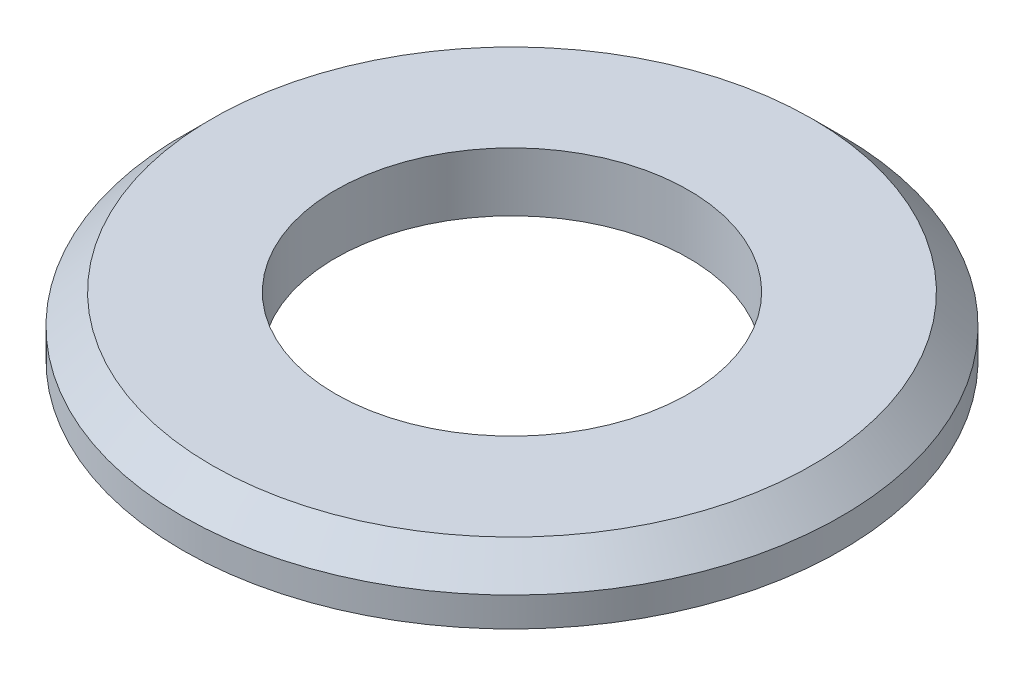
from build123d import *

# Parameters (mm, degrees)
SKETCH1_R      = 14
SKETCH1_R_2    = 7.5
EXTRUDE1_DEPTH = 2.5
CHAMFER1_SIZE  = 1.25


with BuildPart() as part:
    # Sketch1 → Extrude1 (new body)
    with BuildSketch(Plane(origin=(0, 0, 0), x_dir=(1, 0, 0), z_dir=(0, 1, 0))):
        with Locations(Location((0, 0, 0), (0, 0, 270))):
            Circle(SKETCH1_R)
        with Locations(Location((0, 0, 0), (0, 0, 270))):
            Circle(SKETCH1_R_2, mode=Mode.SUBTRACT)
    extrude(amount=EXTRUDE1_DEPTH)

    # Chamfer1
    chamfer1_edges = [part.edges().sort_by_distance(p)[0] for p in [
        (0, 2.5, -14),
    ]]
    chamfer(chamfer1_edges, length=CHAMFER1_SIZE)


solid = part.part
